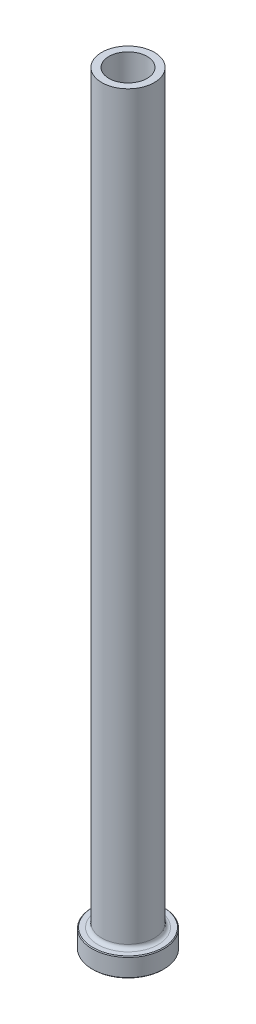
ISO-10303-21;
HEADER;
FILE_DESCRIPTION(('STEP AP214'),'2;1');
FILE_NAME('part.step','',(''),(''),'','','');
FILE_SCHEMA(('AUTOMOTIVE_DESIGN { 1 0 10303 214 1 1 1 1 }'));
ENDSEC;
DATA;
#1=APPLICATION_CONTEXT('core data for automotive mechanical design processes');
#2=APPLICATION_PROTOCOL_DEFINITION('international standard','automotive_design',2000,#1);
#3=PRODUCT_CONTEXT('',#1,'mechanical');
#4=PRODUCT('Part','Part','',(#3));
#5=PRODUCT_RELATED_PRODUCT_CATEGORY('part','',(#4));
#6=PRODUCT_DEFINITION_FORMATION('','',#4);
#7=PRODUCT_DEFINITION_CONTEXT('part definition',#1,'design');
#8=PRODUCT_DEFINITION('design','',#6,#7);
#9=PRODUCT_DEFINITION_SHAPE('','',#8);
#10=(LENGTH_UNIT() NAMED_UNIT(*) SI_UNIT(.MILLI.,.METRE.));
#11=(NAMED_UNIT(*) PLANE_ANGLE_UNIT() SI_UNIT($,.RADIAN.));
#12=(NAMED_UNIT(*) SI_UNIT($,.STERADIAN.) SOLID_ANGLE_UNIT());
#13=UNCERTAINTY_MEASURE_WITH_UNIT(LENGTH_MEASURE(1.E-05),#10,'distance_accuracy_value','');
#14=(GEOMETRIC_REPRESENTATION_CONTEXT(3) GLOBAL_UNCERTAINTY_ASSIGNED_CONTEXT((#13)) GLOBAL_UNIT_ASSIGNED_CONTEXT((#10,
#11,#12)) REPRESENTATION_CONTEXT('',''));
#15=CARTESIAN_POINT('',(0.,0.,0.));
#16=DIRECTION('',(0.,0.,1.));
#17=DIRECTION('',(1.,0.,0.));
#18=AXIS2_PLACEMENT_3D('',#15,#16,#17);
#19=CARTESIAN_POINT('',(0.,0.,0.));
#20=DIRECTION('',(0.,-1.,0.));
#21=DIRECTION('',(0.,0.,-1.));
#22=AXIS2_PLACEMENT_3D('',#19,#20,#21);
#23=PLANE('',#22);
#24=CARTESIAN_POINT('',(0.,0.,0.));
#25=DIRECTION('',(0.,-1.,0.));
#26=DIRECTION('',(0.,0.,-1.));
#27=AXIS2_PLACEMENT_3D('',#24,#25,#26);
#28=CIRCLE('',#27,11.6459);
#29=CARTESIAN_POINT('',(0.,0.,-11.6459));
#30=VERTEX_POINT('',#29);
#31=EDGE_CURVE('E43',#30,#30,#28,.T.);
#32=ORIENTED_EDGE('',*,*,#31,.T.);
#33=EDGE_LOOP('',(#32));
#34=FACE_BOUND('',#33,.T.);
#35=CARTESIAN_POINT('',(0.,0.,0.));
#36=DIRECTION('',(0.,-1.,0.));
#37=DIRECTION('',(0.,0.,-1.));
#38=AXIS2_PLACEMENT_3D('',#35,#36,#37);
#39=CIRCLE('',#38,6.937375);
#40=CARTESIAN_POINT('',(0.,0.,-6.937375));
#41=VERTEX_POINT('',#40);
#42=EDGE_CURVE('E57',#41,#41,#39,.T.);
#43=ORIENTED_EDGE('',*,*,#42,.F.);
#44=EDGE_LOOP('',(#43));
#45=FACE_BOUND('',#44,.T.);
#46=ADVANCED_FACE('F28',(#34,#45),#23,.T.);
#47=CARTESIAN_POINT('',(0.,0.,0.));
#48=DIRECTION('',(0.,-1.,0.));
#49=DIRECTION('',(0.,0.,-1.));
#50=AXIS2_PLACEMENT_3D('',#47,#48,#49);
#51=CYLINDRICAL_SURFACE('',#50,11.8999);
#52=CARTESIAN_POINT('',(0.,0.254000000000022,0.));
#53=DIRECTION('',(0.,-1.,0.));
#54=DIRECTION('',(0.,0.,-1.));
#55=AXIS2_PLACEMENT_3D('',#52,#53,#54);
#56=CIRCLE('',#55,11.8999);
#57=CARTESIAN_POINT('',(0.,0.254000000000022,-11.8999));
#58=VERTEX_POINT('',#57);
#59=EDGE_CURVE('E35',#58,#58,#56,.F.);
#60=ORIENTED_EDGE('',*,*,#59,.T.);
#61=EDGE_LOOP('',(#60));
#62=FACE_BOUND('',#61,.T.);
#63=CARTESIAN_POINT('',(0.,6.096,0.));
#64=DIRECTION('',(0.,1.,0.));
#65=DIRECTION('',(0.,0.,1.));
#66=AXIS2_PLACEMENT_3D('',#63,#64,#65);
#67=CIRCLE('',#66,11.8999);
#68=CARTESIAN_POINT('',(0.,6.096,11.8999));
#69=VERTEX_POINT('',#68);
#70=EDGE_CURVE('E39',#69,#69,#67,.F.);
#71=ORIENTED_EDGE('',*,*,#70,.T.);
#72=EDGE_LOOP('',(#71));
#73=FACE_BOUND('',#72,.T.);
#74=ADVANCED_FACE('F102',(#62,#73),#51,.T.);
#75=CARTESIAN_POINT('',(11.8999,6.35,0.));
#76=DIRECTION('',(0.,1.,0.));
#77=DIRECTION('',(0.,0.,1.));
#78=AXIS2_PLACEMENT_3D('',#75,#76,#77);
#79=PLANE('',#78);
#80=CARTESIAN_POINT('',(0.,6.35,0.));
#81=DIRECTION('',(0.,1.,0.));
#82=DIRECTION('',(0.,0.,1.));
#83=AXIS2_PLACEMENT_3D('',#80,#81,#82);
#84=CIRCLE('',#83,11.6459);
#85=CARTESIAN_POINT('',(0.,6.35,11.6459));
#86=VERTEX_POINT('',#85);
#87=EDGE_CURVE('E10',#86,#86,#84,.T.);
#88=ORIENTED_EDGE('',*,*,#87,.T.);
#89=EDGE_LOOP('',(#88));
#90=FACE_BOUND('',#89,.T.);
#91=CARTESIAN_POINT('',(0.,6.35,0.));
#92=DIRECTION('',(0.,-1.,0.));
#93=DIRECTION('',(0.,0.,-1.));
#94=AXIS2_PLACEMENT_3D('',#91,#92,#93);
#95=CIRCLE('',#94,9.9949);
#96=CARTESIAN_POINT('',(0.,6.35,-9.9949));
#97=VERTEX_POINT('',#96);
#98=EDGE_CURVE('E48',#97,#97,#95,.T.);
#99=ORIENTED_EDGE('',*,*,#98,.T.);
#100=EDGE_LOOP('',(#99));
#101=FACE_BOUND('',#100,.T.);
#102=ADVANCED_FACE('F108',(#90,#101),#79,.T.);
#103=CARTESIAN_POINT('',(0.,7.62,0.));
#104=DIRECTION('',(0.,-1.,0.));
#105=DIRECTION('',(0.,0.,-1.));
#106=AXIS2_PLACEMENT_3D('',#103,#104,#105);
#107=TOROIDAL_SURFACE('',#106,9.9949,1.27);
#108=CARTESIAN_POINT('',(0.,7.62,0.));
#109=DIRECTION('',(0.,-1.,0.));
#110=DIRECTION('',(0.,0.,-1.));
#111=AXIS2_PLACEMENT_3D('',#108,#109,#110);
#112=CIRCLE('',#111,8.7249);
#113=CARTESIAN_POINT('',(0.,7.62,-8.7249));
#114=VERTEX_POINT('',#113);
#115=EDGE_CURVE('E51',#114,#114,#112,.T.);
#116=ORIENTED_EDGE('',*,*,#115,.T.);
#117=EDGE_LOOP('',(#116));
#118=FACE_BOUND('',#117,.T.);
#119=ORIENTED_EDGE('',*,*,#98,.F.);
#120=EDGE_LOOP('',(#119));
#121=FACE_BOUND('',#120,.T.);
#122=ADVANCED_FACE('F138',(#118,#121),#107,.F.);
#123=CARTESIAN_POINT('',(0.,0.,0.));
#124=DIRECTION('',(0.,-1.,0.));
#125=DIRECTION('',(0.,0.,-1.));
#126=AXIS2_PLACEMENT_3D('',#123,#124,#125);
#127=CYLINDRICAL_SURFACE('',#126,8.7249);
#128=CARTESIAN_POINT('',(0.,254.,0.));
#129=DIRECTION('',(0.,-1.,0.));
#130=DIRECTION('',(0.,0.,-1.));
#131=AXIS2_PLACEMENT_3D('',#128,#129,#130);
#132=CIRCLE('',#131,8.7249);
#133=CARTESIAN_POINT('',(0.,254.,-8.7249));
#134=VERTEX_POINT('',#133);
#135=EDGE_CURVE('E54',#134,#134,#132,.T.);
#136=ORIENTED_EDGE('',*,*,#135,.T.);
#137=EDGE_LOOP('',(#136));
#138=FACE_BOUND('',#137,.T.);
#139=ORIENTED_EDGE('',*,*,#115,.F.);
#140=EDGE_LOOP('',(#139));
#141=FACE_BOUND('',#140,.T.);
#142=ADVANCED_FACE('F181',(#138,#141),#127,.T.);
#143=CARTESIAN_POINT('',(8.7249,254.,0.));
#144=DIRECTION('',(0.,1.,0.));
#145=DIRECTION('',(0.,0.,1.));
#146=AXIS2_PLACEMENT_3D('',#143,#144,#145);
#147=PLANE('',#146);
#148=CARTESIAN_POINT('',(0.,254.,0.));
#149=DIRECTION('',(0.,-1.,0.));
#150=DIRECTION('',(0.,0.,-1.));
#151=AXIS2_PLACEMENT_3D('',#148,#149,#150);
#152=CIRCLE('',#151,6.35);
#153=CARTESIAN_POINT('',(0.,254.,-6.35));
#154=VERTEX_POINT('',#153);
#155=EDGE_CURVE('E69',#154,#154,#152,.T.);
#156=ORIENTED_EDGE('',*,*,#155,.T.);
#157=EDGE_LOOP('',(#156));
#158=FACE_BOUND('',#157,.T.);
#159=ORIENTED_EDGE('',*,*,#135,.F.);
#160=EDGE_LOOP('',(#159));
#161=FACE_BOUND('',#160,.T.);
#162=ADVANCED_FACE('F73',(#158,#161),#147,.T.);
#163=CARTESIAN_POINT('',(0.,0.,0.));
#164=DIRECTION('',(0.,-1.,0.));
#165=DIRECTION('',(0.,0.,-1.));
#166=AXIS2_PLACEMENT_3D('',#163,#164,#165);
#167=CONICAL_SURFACE('',#166,6.937375,0.785398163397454);
#168=CARTESIAN_POINT('',(0.,0.396875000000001,0.));
#169=DIRECTION('',(0.,-1.,0.));
#170=DIRECTION('',(0.,0.,-1.));
#171=AXIS2_PLACEMENT_3D('',#168,#169,#170);
#172=CIRCLE('',#171,6.5405);
#173=CARTESIAN_POINT('',(0.,0.396875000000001,-6.5405));
#174=VERTEX_POINT('',#173);
#175=EDGE_CURVE('E60',#174,#174,#172,.T.);
#176=ORIENTED_EDGE('',*,*,#175,.F.);
#177=EDGE_LOOP('',(#176));
#178=FACE_BOUND('',#177,.T.);
#179=ORIENTED_EDGE('',*,*,#42,.T.);
#180=EDGE_LOOP('',(#179));
#181=FACE_BOUND('',#180,.T.);
#182=ADVANCED_FACE('F92',(#178,#181),#167,.F.);
#183=CARTESIAN_POINT('',(0.,0.,0.));
#184=DIRECTION('',(0.,-1.,0.));
#185=DIRECTION('',(0.,0.,-1.));
#186=AXIS2_PLACEMENT_3D('',#183,#184,#185);
#187=CYLINDRICAL_SURFACE('',#186,6.5405);
#188=CARTESIAN_POINT('',(0.,179.5145,0.));
#189=DIRECTION('',(0.,-1.,0.));
#190=DIRECTION('',(0.,0.,-1.));
#191=AXIS2_PLACEMENT_3D('',#188,#189,#190);
#192=CIRCLE('',#191,6.5405);
#193=CARTESIAN_POINT('',(0.,179.5145,-6.5405));
#194=VERTEX_POINT('',#193);
#195=EDGE_CURVE('E63',#194,#194,#192,.T.);
#196=ORIENTED_EDGE('',*,*,#195,.F.);
#197=EDGE_LOOP('',(#196));
#198=FACE_BOUND('',#197,.T.);
#199=ORIENTED_EDGE('',*,*,#175,.T.);
#200=EDGE_LOOP('',(#199));
#201=FACE_BOUND('',#200,.T.);
#202=ADVANCED_FACE('F86',(#198,#201),#187,.F.);
#203=CARTESIAN_POINT('',(0.,179.5145,0.));
#204=DIRECTION('',(0.,-1.,0.));
#205=DIRECTION('',(0.,0.,-1.));
#206=AXIS2_PLACEMENT_3D('',#203,#204,#205);
#207=CONICAL_SURFACE('',#206,6.5405,0.0133325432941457);
#208=CARTESIAN_POINT('',(0.,193.802,0.));
#209=DIRECTION('',(0.,-1.,0.));
#210=DIRECTION('',(0.,0.,-1.));
#211=AXIS2_PLACEMENT_3D('',#208,#209,#210);
#212=CIRCLE('',#211,6.35);
#213=CARTESIAN_POINT('',(0.,193.802,-6.35));
#214=VERTEX_POINT('',#213);
#215=EDGE_CURVE('E66',#214,#214,#212,.T.);
#216=ORIENTED_EDGE('',*,*,#215,.F.);
#217=EDGE_LOOP('',(#216));
#218=FACE_BOUND('',#217,.T.);
#219=ORIENTED_EDGE('',*,*,#195,.T.);
#220=EDGE_LOOP('',(#219));
#221=FACE_BOUND('',#220,.T.);
#222=ADVANCED_FACE('F80',(#218,#221),#207,.F.);
#223=CARTESIAN_POINT('',(0.,0.,0.));
#224=DIRECTION('',(0.,-1.,0.));
#225=DIRECTION('',(0.,0.,-1.));
#226=AXIS2_PLACEMENT_3D('',#223,#224,#225);
#227=CYLINDRICAL_SURFACE('',#226,6.35);
#228=ORIENTED_EDGE('',*,*,#155,.F.);
#229=EDGE_LOOP('',(#228));
#230=FACE_BOUND('',#229,.T.);
#231=ORIENTED_EDGE('',*,*,#215,.T.);
#232=EDGE_LOOP('',(#231));
#233=FACE_BOUND('',#232,.T.);
#234=ADVANCED_FACE('F76',(#230,#233),#227,.F.);
#235=CARTESIAN_POINT('',(0.,0.,0.));
#236=DIRECTION('',(0.,1.,0.));
#237=DIRECTION('',(0.,0.,1.));
#238=AXIS2_PLACEMENT_3D('',#235,#236,#237);
#239=CONICAL_SURFACE('',#238,11.6459,0.785398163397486);
#240=ORIENTED_EDGE('',*,*,#59,.F.);
#241=EDGE_LOOP('',(#240));
#242=FACE_BOUND('',#241,.T.);
#243=ORIENTED_EDGE('',*,*,#31,.F.);
#244=EDGE_LOOP('',(#243));
#245=FACE_BOUND('',#244,.T.);
#246=ADVANCED_FACE('F79',(#242,#245),#239,.T.);
#247=CARTESIAN_POINT('',(0.,6.096,0.));
#248=DIRECTION('',(0.,-1.,0.));
#249=DIRECTION('',(0.,0.,-1.));
#250=AXIS2_PLACEMENT_3D('',#247,#248,#249);
#251=CONICAL_SURFACE('',#250,11.8999,0.785398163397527);
#252=ORIENTED_EDGE('',*,*,#87,.F.);
#253=EDGE_LOOP('',(#252));
#254=FACE_BOUND('',#253,.T.);
#255=ORIENTED_EDGE('',*,*,#70,.F.);
#256=EDGE_LOOP('',(#255));
#257=FACE_BOUND('',#256,.T.);
#258=ADVANCED_FACE('F30',(#254,#257),#251,.T.);
#259=CLOSED_SHELL('',(#46,#74,#102,#122,#142,#162,#182,#202,#222,#234,#246,#258));
#260=MANIFOLD_SOLID_BREP('B2',#259);
#261=ADVANCED_BREP_SHAPE_REPRESENTATION('',(#18,#260),#14);
#262=SHAPE_DEFINITION_REPRESENTATION(#9,#261);
ENDSEC;
END-ISO-10303-21;
